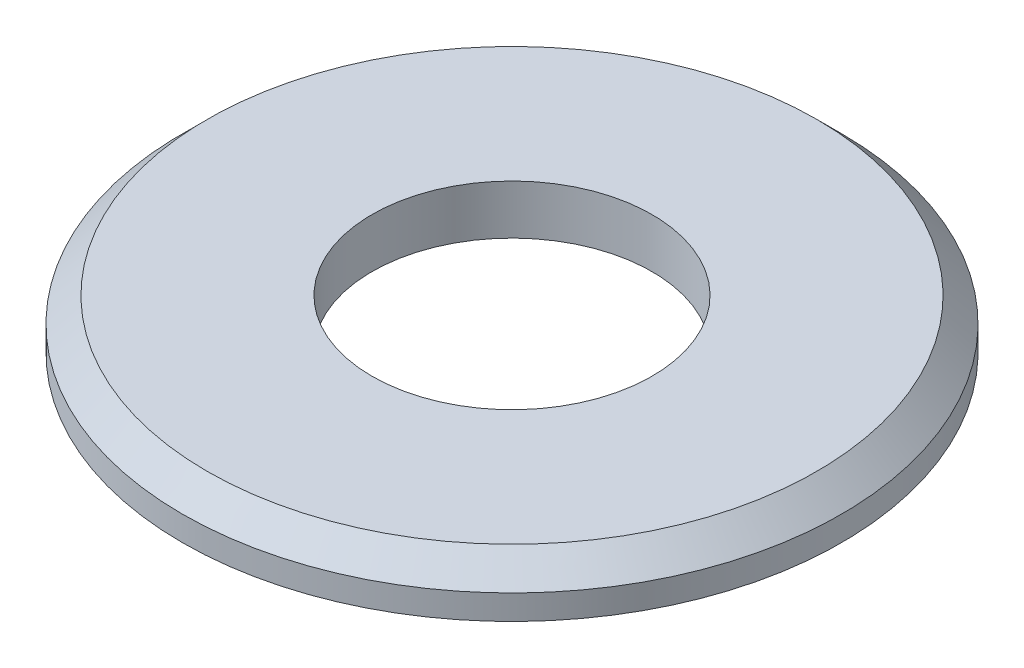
from build123d import *

# Parameters (mm, degrees)
SKETCH1_R      = 2
SKETCH1_R_2    = 0.85
EXTRUDE1_DEPTH = 0.3
CHAMFER1_SIZE  = 0.15


with BuildPart() as part:
    # Sketch1 → Extrude1 (new body)
    with BuildSketch(Plane(origin=(0, 0, 0), x_dir=(1, 0, 0), z_dir=(0, 1, 0))):
        with Locations(Location((0, 0, 0), (0, 0, 270))):
            Circle(SKETCH1_R)
        with Locations(Location((0, 0, 0), (0, 0, 270))):
            Circle(SKETCH1_R_2, mode=Mode.SUBTRACT)
    extrude(amount=EXTRUDE1_DEPTH)

    # Chamfer1
    chamfer1_edges = [part.edges().sort_by_distance(p)[0] for p in [
        (0, 0.3, -2),
    ]]
    chamfer(chamfer1_edges, length=CHAMFER1_SIZE)


solid = part.part
